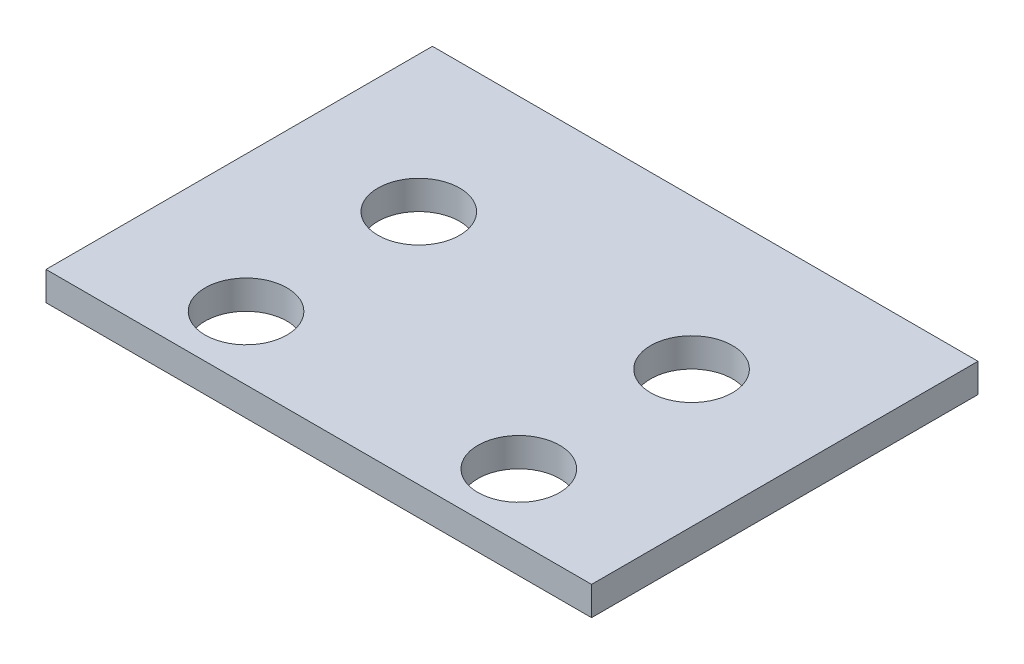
from build123d import *

# Parameters (mm, degrees)
SKETCH1_W       = 60
SKETCH1_H       = 42.5
EXTRUDE1_DEPTH  = 3.175
LPATTERN1_COUNT = 2
LPATTERN1_PITCH = 19


with BuildPart() as part:
    # Sketch1 → Extrude1 (new body)
    with BuildSketch(Plane(origin=(0, 0, 0), x_dir=(1, 0, 0), z_dir=(0, 1, 0))):
        Rectangle(SKETCH1_W, SKETCH1_H)
    extrude(amount=EXTRUDE1_DEPTH)

    # Sketch14 → M8 Clearance Hole4 (revolve, cut)
    with BuildSketch(Plane(origin=(-15, 3.175, 14.25), x_dir=(0, 0, 1), z_dir=(1, 0, 0))):
        Polygon((0, 0), (0, 9.053872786), (4.5, 6.35), (4.5, 0), align=None)
    m8_clearance_hole4 = revolve(axis=Axis((-15, 9.525, 14.25), (0, -1, 0)), mode=Mode.SUBTRACT)

    # Mirror1: M8 Clearance Hole4 across plane
    add(m8_clearance_hole4.mirror(Plane(origin=(0, 0, 0), x_dir=(0, 0, 1), z_dir=(1, 0, 0))), mode=Mode.SUBTRACT)

    # LPattern1: M8 Clearance Hole4 ×2
    with Locations(*[(0, 0, -i * LPATTERN1_PITCH) for i in range(1, LPATTERN1_COUNT)]):
        add(m8_clearance_hole4, mode=Mode.SUBTRACT)

    # LPattern1 copy 1 sketch → LPattern1 copy 1 (revolve, cut)
    with BuildSketch(Plane(origin=(15, 3.175, -4.75), x_dir=(0, 0, 1), z_dir=(-1, 0, 0))):
        Polygon((0, 0), (0, -9.053872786), (4.5, -6.35), (4.5, 0), align=None)
    revolve(axis=Axis((15, 9.525, -4.75), (0, 1, 0)), mode=Mode.SUBTRACT)


solid = part.part
